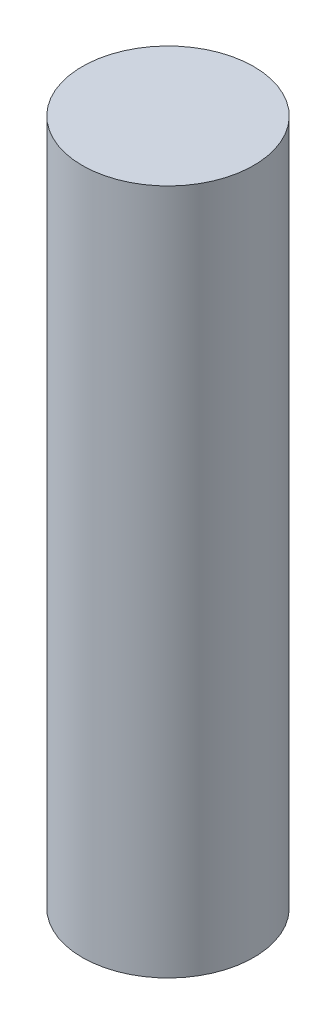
ISO-10303-21;
HEADER;
FILE_DESCRIPTION(('STEP AP214'),'2;1');
FILE_NAME('part.step','',(''),(''),'','','');
FILE_SCHEMA(('AUTOMOTIVE_DESIGN { 1 0 10303 214 1 1 1 1 }'));
ENDSEC;
DATA;
#1=APPLICATION_CONTEXT('core data for automotive mechanical design processes');
#2=APPLICATION_PROTOCOL_DEFINITION('international standard','automotive_design',2000,#1);
#3=PRODUCT_CONTEXT('',#1,'mechanical');
#4=PRODUCT('Part','Part','',(#3));
#5=PRODUCT_RELATED_PRODUCT_CATEGORY('part','',(#4));
#6=PRODUCT_DEFINITION_FORMATION('','',#4);
#7=PRODUCT_DEFINITION_CONTEXT('part definition',#1,'design');
#8=PRODUCT_DEFINITION('design','',#6,#7);
#9=PRODUCT_DEFINITION_SHAPE('','',#8);
#10=(LENGTH_UNIT() NAMED_UNIT(*) SI_UNIT(.MILLI.,.METRE.));
#11=(NAMED_UNIT(*) PLANE_ANGLE_UNIT() SI_UNIT($,.RADIAN.));
#12=(NAMED_UNIT(*) SI_UNIT($,.STERADIAN.) SOLID_ANGLE_UNIT());
#13=UNCERTAINTY_MEASURE_WITH_UNIT(LENGTH_MEASURE(1.E-05),#10,'distance_accuracy_value','');
#14=(GEOMETRIC_REPRESENTATION_CONTEXT(3) GLOBAL_UNCERTAINTY_ASSIGNED_CONTEXT((#13)) GLOBAL_UNIT_ASSIGNED_CONTEXT((#10,
#11,#12)) REPRESENTATION_CONTEXT('',''));
#15=CARTESIAN_POINT('',(0.,0.,0.));
#16=DIRECTION('',(0.,0.,1.));
#17=DIRECTION('',(1.,0.,0.));
#18=AXIS2_PLACEMENT_3D('',#15,#16,#17);
#19=CARTESIAN_POINT('',(0.,10.,0.));
#20=DIRECTION('',(0.,-1.,0.));
#21=DIRECTION('',(0.,0.,-1.));
#22=AXIS2_PLACEMENT_3D('',#19,#20,#21);
#23=CYLINDRICAL_SURFACE('',#22,2.5);
#24=CARTESIAN_POINT('',(0.,10.,0.));
#25=DIRECTION('',(0.,1.,0.));
#26=DIRECTION('',(0.,0.,1.));
#27=AXIS2_PLACEMENT_3D('',#24,#25,#26);
#28=CIRCLE('',#27,2.5);
#29=CARTESIAN_POINT('',(0.,10.,2.5));
#30=VERTEX_POINT('',#29);
#31=EDGE_CURVE('E10',#30,#30,#28,.T.);
#32=ORIENTED_EDGE('',*,*,#31,.F.);
#33=EDGE_LOOP('',(#32));
#34=FACE_BOUND('',#33,.T.);
#35=CARTESIAN_POINT('',(0.,-10.,0.));
#36=DIRECTION('',(0.,1.,0.));
#37=DIRECTION('',(0.,0.,1.));
#38=AXIS2_PLACEMENT_3D('',#35,#36,#37);
#39=CIRCLE('',#38,2.5);
#40=CARTESIAN_POINT('',(0.,-10.,2.5));
#41=VERTEX_POINT('',#40);
#42=EDGE_CURVE('E42',#41,#41,#39,.T.);
#43=ORIENTED_EDGE('',*,*,#42,.T.);
#44=EDGE_LOOP('',(#43));
#45=FACE_BOUND('',#44,.T.);
#46=ADVANCED_FACE('F39',(#34,#45),#23,.T.);
#47=CARTESIAN_POINT('',(0.,10.,0.));
#48=DIRECTION('',(0.,1.,0.));
#49=DIRECTION('',(0.,0.,1.));
#50=AXIS2_PLACEMENT_3D('',#47,#48,#49);
#51=PLANE('',#50);
#52=ORIENTED_EDGE('',*,*,#31,.T.);
#53=EDGE_LOOP('',(#52));
#54=FACE_BOUND('',#53,.T.);
#55=ADVANCED_FACE('F54',(#54),#51,.T.);
#56=CARTESIAN_POINT('',(0.,-10.,0.));
#57=DIRECTION('',(0.,1.,0.));
#58=DIRECTION('',(0.,0.,1.));
#59=AXIS2_PLACEMENT_3D('',#56,#57,#58);
#60=PLANE('',#59);
#61=ORIENTED_EDGE('',*,*,#42,.F.);
#62=EDGE_LOOP('',(#61));
#63=FACE_BOUND('',#62,.T.);
#64=ADVANCED_FACE('F52',(#63),#60,.F.);
#65=CLOSED_SHELL('',(#46,#55,#64));
#66=MANIFOLD_SOLID_BREP('B2',#65);
#67=ADVANCED_BREP_SHAPE_REPRESENTATION('',(#18,#66),#14);
#68=SHAPE_DEFINITION_REPRESENTATION(#9,#67);
ENDSEC;
END-ISO-10303-21;
